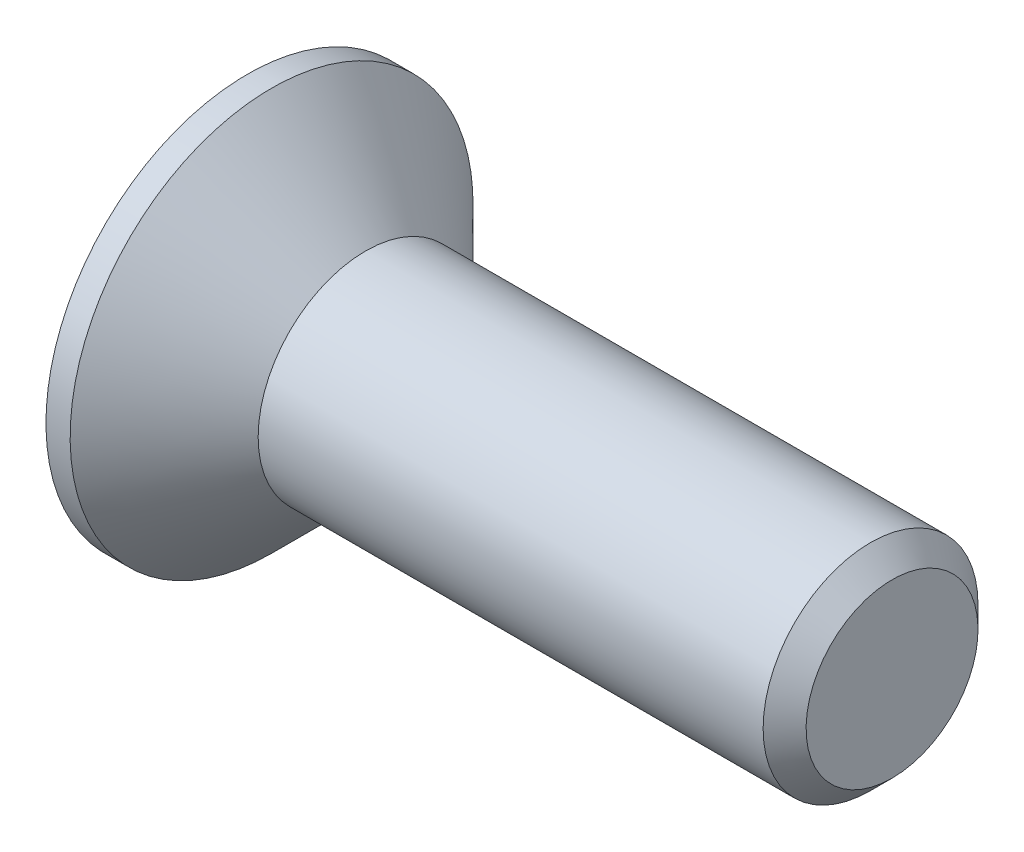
from build123d import *

# Parameters (mm, degrees)
CHAMFER1_SIZE      = 0.4
CUT_EXTRUDE1_DEPTH = 1.9


with BuildPart() as part:
    # Sketch1 → Revolve1 (revolve)
    with BuildSketch(Plane.XY, mode=Mode.PRIVATE) as revolve1_sk:
        Polygon((-2.2, 3.75), (-2.2, 0), (9.8, 0), (9.8, 2), (0, 2), (-1.75, 3.75), align=None)
    revolve(revolve1_sk.sketch.rotate(Axis((-2.2, 0, 0), (1, 0, 0)), 180), axis=Axis((-2.2, 0, 0), (1, 0, 0)))

    # Chamfer1
    chamfer1_edges = [part.edges().sort_by_distance(p)[0] for p in [
        (9.8, 2, 0),
    ]]
    chamfer(chamfer1_edges, length=CHAMFER1_SIZE)

    # Sketch2 → Cut-Extrude1 (cut)
    with BuildSketch(Plane.ZY.offset(2.2)):
        Polygon((-0.55, 2.2), (0.55, 2.2), (0.55, 0.55), (2.2, 0.55), (2.2, -0.55), (0.55, -0.55), (0.55, -2.2), (-0.55, -2.2), (-0.55, -0.55), (-2.2, -0.55), (-2.2, 0.55), (-0.55, 0.55), align=None)
    extrude(amount=-CUT_EXTRUDE1_DEPTH, mode=Mode.SUBTRACT)


solid = part.part
